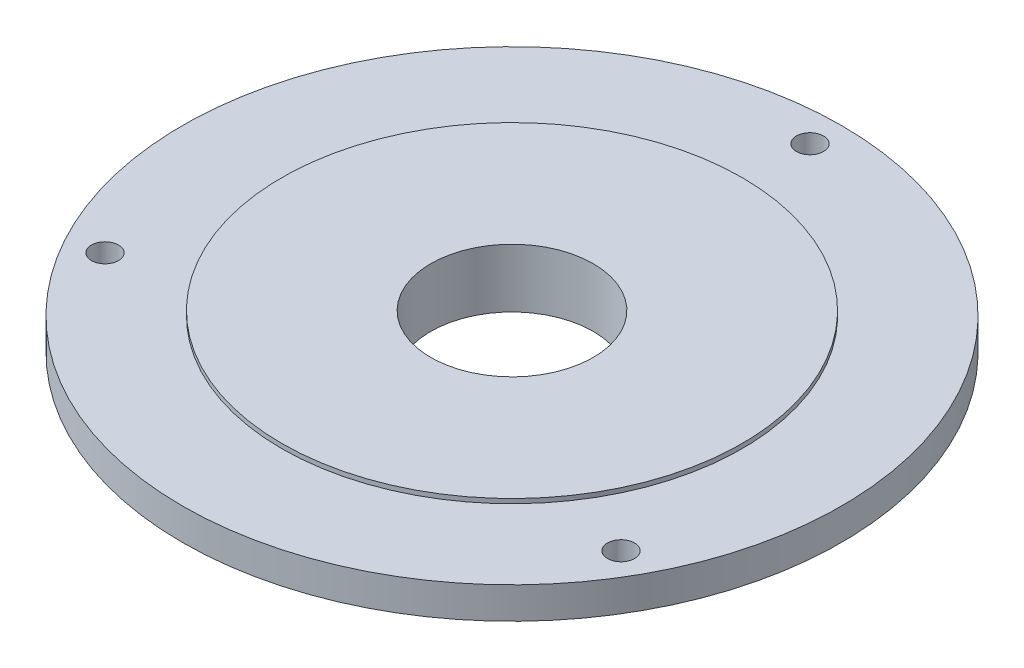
from build123d import *

# Parameters (mm, degrees)
SCHIZZO2_R               = 1.5
TAGLIO_ESTRUSIONE1_DEPTH = 52.966335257


with BuildPart() as part:
    # Schizzo1 → Rivoluzione1 (revolve)
    with BuildSketch(Plane.XY, mode=Mode.PRIVATE) as rivoluzione1_sk:
        Polygon((36.5, 37.885931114), (36.5, 34.385931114), (14.25, 34.385931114), (14.25, 31.885931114), (9, 31.885931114), (9, 38.385931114), (25.5, 38.385931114), (25.5, 37.885931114), align=None)
    revolve(rivoluzione1_sk.sketch.rotate(Axis((0, 0, 0), (0, 1, 0)), 90), axis=Axis((0, 0, 0), (0, 1, 0)))

    # Schizzo2 → Taglio-Estrusione1 (cut, through all)
    with BuildSketch(Plane(origin=(0, 37.885931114, 0), x_dir=(1, 0, 0), z_dir=(0, 1, 0))):
        with Locations(Location((0, 33, 0), (0, 0, 270))):
            Circle(SCHIZZO2_R)
        with Locations(Location((28.578838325, -16.5, 0), (0, 0, 270))):
            Circle(SCHIZZO2_R)
        with Locations(Location((-28.578838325, -16.5, 0), (0, 0, 270))):
            Circle(SCHIZZO2_R)
    extrude(amount=-TAGLIO_ESTRUSIONE1_DEPTH, mode=Mode.SUBTRACT)


solid = part.part
